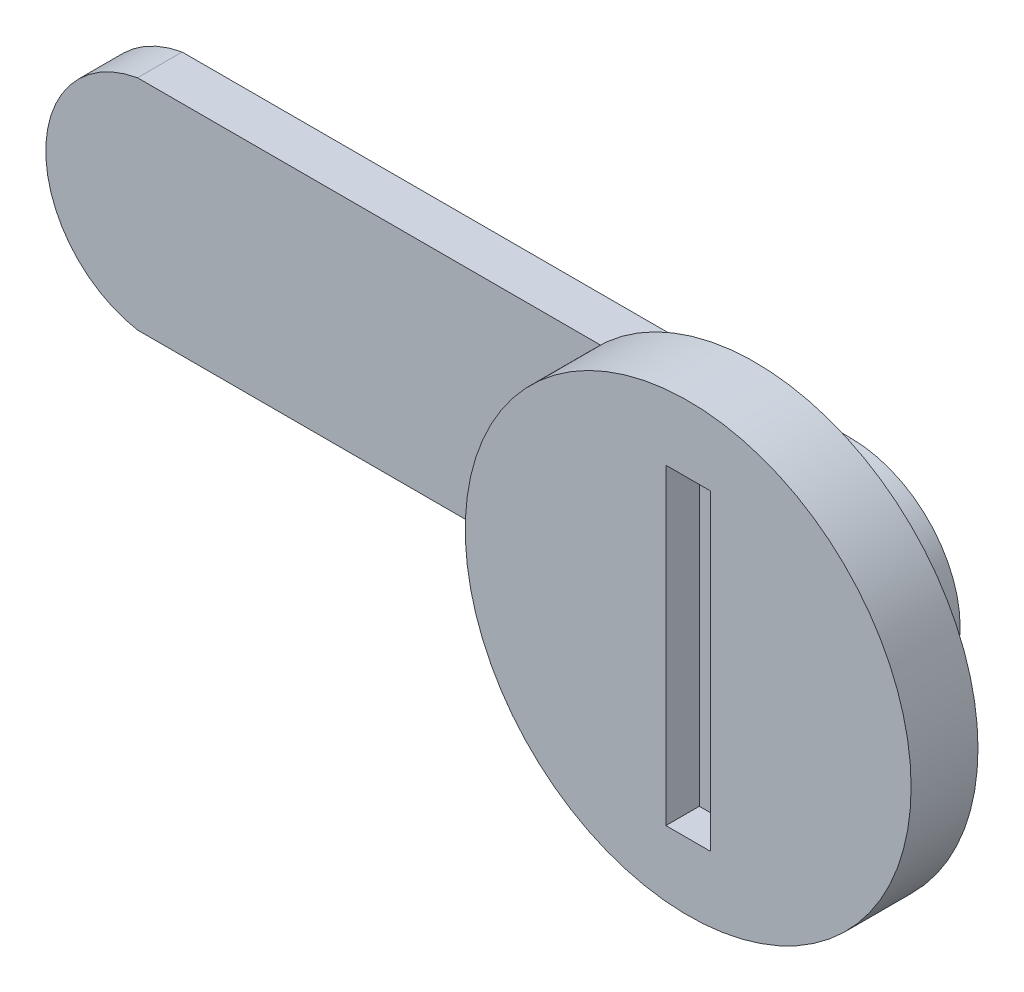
ISO-10303-21;
HEADER;
FILE_DESCRIPTION(('STEP AP214'),'2;1');
FILE_NAME('part.step','',(''),(''),'','','');
FILE_SCHEMA(('AUTOMOTIVE_DESIGN { 1 0 10303 214 1 1 1 1 }'));
ENDSEC;
DATA;
#1=APPLICATION_CONTEXT('core data for automotive mechanical design processes');
#2=APPLICATION_PROTOCOL_DEFINITION('international standard','automotive_design',2000,#1);
#3=PRODUCT_CONTEXT('',#1,'mechanical');
#4=PRODUCT('Part','Part','',(#3));
#5=PRODUCT_RELATED_PRODUCT_CATEGORY('part','',(#4));
#6=PRODUCT_DEFINITION_FORMATION('','',#4);
#7=PRODUCT_DEFINITION_CONTEXT('part definition',#1,'design');
#8=PRODUCT_DEFINITION('design','',#6,#7);
#9=PRODUCT_DEFINITION_SHAPE('','',#8);
#10=(LENGTH_UNIT() NAMED_UNIT(*) SI_UNIT(.MILLI.,.METRE.));
#11=(NAMED_UNIT(*) PLANE_ANGLE_UNIT() SI_UNIT($,.RADIAN.));
#12=(NAMED_UNIT(*) SI_UNIT($,.STERADIAN.) SOLID_ANGLE_UNIT());
#13=UNCERTAINTY_MEASURE_WITH_UNIT(LENGTH_MEASURE(1.E-05),#10,'distance_accuracy_value','');
#14=(GEOMETRIC_REPRESENTATION_CONTEXT(3) GLOBAL_UNCERTAINTY_ASSIGNED_CONTEXT((#13)) GLOBAL_UNIT_ASSIGNED_CONTEXT((#10,
#11,#12)) REPRESENTATION_CONTEXT('',''));
#15=CARTESIAN_POINT('',(0.,0.,0.));
#16=DIRECTION('',(0.,0.,1.));
#17=DIRECTION('',(1.,0.,0.));
#18=AXIS2_PLACEMENT_3D('',#15,#16,#17);
#19=CARTESIAN_POINT('',(0.,0.,3.));
#20=DIRECTION('',(0.,0.,1.));
#21=DIRECTION('',(1.,0.,0.));
#22=AXIS2_PLACEMENT_3D('',#19,#20,#21);
#23=PLANE('',#22);
#24=CARTESIAN_POINT('',(0.,0.,3.));
#25=DIRECTION('',(0.,0.,1.));
#26=DIRECTION('',(1.,0.,0.));
#27=AXIS2_PLACEMENT_3D('',#24,#25,#26);
#28=CIRCLE('',#27,10.);
#29=CARTESIAN_POINT('',(10.,0.,3.));
#30=VERTEX_POINT('',#29);
#31=EDGE_CURVE('E43',#30,#30,#28,.T.);
#32=ORIENTED_EDGE('',*,*,#31,.T.);
#33=EDGE_LOOP('',(#32));
#34=FACE_BOUND('',#33,.T.);
#35=DIRECTION('',(1.,0.,0.));
#36=VECTOR('',#35,1.);
#37=CARTESIAN_POINT('',(0.,7.,3.));
#38=LINE('',#37,#36);
#39=CARTESIAN_POINT('',(-1.,7.,3.));
#40=VERTEX_POINT('',#39);
#41=CARTESIAN_POINT('',(1.,7.,3.));
#42=VERTEX_POINT('',#41);
#43=EDGE_CURVE('E141',#40,#42,#38,.T.);
#44=ORIENTED_EDGE('',*,*,#43,.T.);
#45=DIRECTION('',(0.,-1.,0.));
#46=VECTOR('',#45,1.);
#47=CARTESIAN_POINT('',(1.,0.,3.));
#48=LINE('',#47,#46);
#49=CARTESIAN_POINT('',(0.999999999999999,-7.,3.));
#50=VERTEX_POINT('',#49);
#51=EDGE_CURVE('E59',#42,#50,#48,.T.);
#52=ORIENTED_EDGE('',*,*,#51,.T.);
#53=DIRECTION('',(1.,0.,0.));
#54=VECTOR('',#53,1.);
#55=CARTESIAN_POINT('',(0.,-7.,3.));
#56=LINE('',#55,#54);
#57=CARTESIAN_POINT('',(-0.999999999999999,-7.,3.));
#58=VERTEX_POINT('',#57);
#59=EDGE_CURVE('E132',#58,#50,#56,.T.);
#60=ORIENTED_EDGE('',*,*,#59,.F.);
#61=DIRECTION('',(0.,1.,0.));
#62=VECTOR('',#61,1.);
#63=CARTESIAN_POINT('',(-1.,0.,3.));
#64=LINE('',#63,#62);
#65=EDGE_CURVE('E144',#58,#40,#64,.T.);
#66=ORIENTED_EDGE('',*,*,#65,.T.);
#67=EDGE_LOOP('',(#44,#52,#60,#66));
#68=FACE_BOUND('',#67,.T.);
#69=ADVANCED_FACE('F34',(#34,#68),#23,.T.);
#70=CARTESIAN_POINT('',(0.,0.,3.));
#71=DIRECTION('',(0.,0.,-1.));
#72=DIRECTION('',(-1.,0.,0.));
#73=AXIS2_PLACEMENT_3D('',#70,#71,#72);
#74=CYLINDRICAL_SURFACE('',#73,10.);
#75=ORIENTED_EDGE('',*,*,#31,.F.);
#76=EDGE_LOOP('',(#75));
#77=FACE_BOUND('',#76,.T.);
#78=CARTESIAN_POINT('',(0.,0.,0.));
#79=DIRECTION('',(0.,0.,1.));
#80=DIRECTION('',(1.,0.,0.));
#81=AXIS2_PLACEMENT_3D('',#78,#79,#80);
#82=CIRCLE('',#81,10.);
#83=CARTESIAN_POINT('',(10.,0.,0.));
#84=VERTEX_POINT('',#83);
#85=EDGE_CURVE('E38',#84,#84,#82,.T.);
#86=ORIENTED_EDGE('',*,*,#85,.T.);
#87=EDGE_LOOP('',(#86));
#88=FACE_BOUND('',#87,.T.);
#89=ADVANCED_FACE('F36',(#77,#88),#74,.T.);
#90=CARTESIAN_POINT('',(0.,0.,0.));
#91=DIRECTION('',(0.,0.,1.));
#92=DIRECTION('',(1.,0.,0.));
#93=AXIS2_PLACEMENT_3D('',#90,#91,#92);
#94=PLANE('',#93);
#95=CARTESIAN_POINT('',(0.,0.,0.));
#96=DIRECTION('',(0.,0.,-1.));
#97=DIRECTION('',(-1.,0.,0.));
#98=AXIS2_PLACEMENT_3D('',#95,#96,#97);
#99=CIRCLE('',#98,4.9);
#100=CARTESIAN_POINT('',(-4.9,0.,0.));
#101=VERTEX_POINT('',#100);
#102=EDGE_CURVE('E11',#101,#101,#99,.T.);
#103=ORIENTED_EDGE('',*,*,#102,.F.);
#104=EDGE_LOOP('',(#103));
#105=FACE_BOUND('',#104,.T.);
#106=ORIENTED_EDGE('',*,*,#85,.F.);
#107=EDGE_LOOP('',(#106));
#108=FACE_BOUND('',#107,.T.);
#109=ADVANCED_FACE('F162',(#105,#108),#94,.F.);
#110=CARTESIAN_POINT('',(1.,0.,1.5));
#111=DIRECTION('',(-1.,0.,0.));
#112=DIRECTION('',(0.,-1.,0.));
#113=AXIS2_PLACEMENT_3D('',#110,#111,#112);
#114=PLANE('',#113);
#115=ORIENTED_EDGE('',*,*,#51,.F.);
#116=DIRECTION('',(0.,0.,1.));
#117=VECTOR('',#116,1.);
#118=CARTESIAN_POINT('',(1.,7.,1.5));
#119=LINE('',#118,#117);
#120=CARTESIAN_POINT('',(1.,7.,1.5));
#121=VERTEX_POINT('',#120);
#122=EDGE_CURVE('E139',#121,#42,#119,.T.);
#123=ORIENTED_EDGE('',*,*,#122,.F.);
#124=DIRECTION('',(0.,-1.,0.));
#125=VECTOR('',#124,1.);
#126=CARTESIAN_POINT('',(1.,0.,1.5));
#127=LINE('',#126,#125);
#128=CARTESIAN_POINT('',(0.999999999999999,-7.,1.5));
#129=VERTEX_POINT('',#128);
#130=EDGE_CURVE('E129',#121,#129,#127,.T.);
#131=ORIENTED_EDGE('',*,*,#130,.T.);
#132=DIRECTION('',(0.,0.,1.));
#133=VECTOR('',#132,1.);
#134=CARTESIAN_POINT('',(0.999999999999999,-7.,1.5));
#135=LINE('',#134,#133);
#136=EDGE_CURVE('E149',#129,#50,#135,.T.);
#137=ORIENTED_EDGE('',*,*,#136,.T.);
#138=EDGE_LOOP('',(#115,#123,#131,#137));
#139=FACE_BOUND('',#138,.T.);
#140=ADVANCED_FACE('F164',(#139),#114,.T.);
#141=CARTESIAN_POINT('',(0.,-7.,1.5));
#142=DIRECTION('',(0.,-1.,0.));
#143=DIRECTION('',(0.,0.,-1.));
#144=AXIS2_PLACEMENT_3D('',#141,#142,#143);
#145=PLANE('',#144);
#146=ORIENTED_EDGE('',*,*,#59,.T.);
#147=ORIENTED_EDGE('',*,*,#136,.F.);
#148=DIRECTION('',(1.,0.,0.));
#149=VECTOR('',#148,1.);
#150=CARTESIAN_POINT('',(0.,-7.,1.5));
#151=LINE('',#150,#149);
#152=CARTESIAN_POINT('',(-0.999999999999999,-7.,1.5));
#153=VERTEX_POINT('',#152);
#154=EDGE_CURVE('E136',#153,#129,#151,.T.);
#155=ORIENTED_EDGE('',*,*,#154,.F.);
#156=DIRECTION('',(0.,0.,1.));
#157=VECTOR('',#156,1.);
#158=CARTESIAN_POINT('',(-0.999999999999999,-7.,1.5));
#159=LINE('',#158,#157);
#160=EDGE_CURVE('E151',#153,#58,#159,.T.);
#161=ORIENTED_EDGE('',*,*,#160,.T.);
#162=EDGE_LOOP('',(#146,#147,#155,#161));
#163=FACE_BOUND('',#162,.T.);
#164=ADVANCED_FACE('F170',(#163),#145,.F.);
#165=CARTESIAN_POINT('',(-1.,0.,1.5));
#166=DIRECTION('',(1.,0.,0.));
#167=DIRECTION('',(0.,0.,-1.));
#168=AXIS2_PLACEMENT_3D('',#165,#166,#167);
#169=PLANE('',#168);
#170=ORIENTED_EDGE('',*,*,#65,.F.);
#171=ORIENTED_EDGE('',*,*,#160,.F.);
#172=DIRECTION('',(0.,1.,0.));
#173=VECTOR('',#172,1.);
#174=CARTESIAN_POINT('',(-1.,0.,1.5));
#175=LINE('',#174,#173);
#176=CARTESIAN_POINT('',(-1.,7.,1.5));
#177=VERTEX_POINT('',#176);
#178=EDGE_CURVE('E134',#153,#177,#175,.T.);
#179=ORIENTED_EDGE('',*,*,#178,.T.);
#180=DIRECTION('',(0.,0.,1.));
#181=VECTOR('',#180,1.);
#182=CARTESIAN_POINT('',(-1.,7.,1.5));
#183=LINE('',#182,#181);
#184=EDGE_CURVE('E153',#177,#40,#183,.T.);
#185=ORIENTED_EDGE('',*,*,#184,.T.);
#186=EDGE_LOOP('',(#170,#171,#179,#185));
#187=FACE_BOUND('',#186,.T.);
#188=ADVANCED_FACE('F184',(#187),#169,.T.);
#189=CARTESIAN_POINT('',(0.,7.,1.5));
#190=DIRECTION('',(0.,-1.,0.));
#191=DIRECTION('',(0.,0.,-1.));
#192=AXIS2_PLACEMENT_3D('',#189,#190,#191);
#193=PLANE('',#192);
#194=ORIENTED_EDGE('',*,*,#43,.F.);
#195=ORIENTED_EDGE('',*,*,#184,.F.);
#196=DIRECTION('',(1.,0.,0.));
#197=VECTOR('',#196,1.);
#198=CARTESIAN_POINT('',(0.,7.,1.5));
#199=LINE('',#198,#197);
#200=EDGE_CURVE('E131',#177,#121,#199,.T.);
#201=ORIENTED_EDGE('',*,*,#200,.T.);
#202=ORIENTED_EDGE('',*,*,#122,.T.);
#203=EDGE_LOOP('',(#194,#195,#201,#202));
#204=FACE_BOUND('',#203,.T.);
#205=ADVANCED_FACE('F180',(#204),#193,.T.);
#206=CARTESIAN_POINT('',(0.,0.,1.5));
#207=DIRECTION('',(0.,0.,1.));
#208=DIRECTION('',(1.,0.,0.));
#209=AXIS2_PLACEMENT_3D('',#206,#207,#208);
#210=PLANE('',#209);
#211=ORIENTED_EDGE('',*,*,#130,.F.);
#212=ORIENTED_EDGE('',*,*,#200,.F.);
#213=ORIENTED_EDGE('',*,*,#178,.F.);
#214=ORIENTED_EDGE('',*,*,#154,.T.);
#215=EDGE_LOOP('',(#211,#212,#213,#214));
#216=FACE_BOUND('',#215,.T.);
#217=ADVANCED_FACE('F183',(#216),#210,.T.);
#218=CARTESIAN_POINT('',(0.,0.,-2.3));
#219=DIRECTION('',(0.,0.,1.));
#220=DIRECTION('',(1.,0.,0.));
#221=AXIS2_PLACEMENT_3D('',#218,#219,#220);
#222=CYLINDRICAL_SURFACE('',#221,4.9);
#223=CARTESIAN_POINT('',(0.,0.,-2.3));
#224=DIRECTION('',(0.,0.,-1.));
#225=DIRECTION('',(-1.,0.,0.));
#226=AXIS2_PLACEMENT_3D('',#223,#224,#225);
#227=CIRCLE('',#226,4.9);
#228=CARTESIAN_POINT('',(0.,-4.9,-2.3));
#229=VERTEX_POINT('',#228);
#230=CARTESIAN_POINT('',(0.,4.9,-2.3));
#231=VERTEX_POINT('',#230);
#232=EDGE_CURVE('E51',#229,#231,#227,.T.);
#233=ORIENTED_EDGE('',*,*,#232,.F.);
#234=DIRECTION('',(0.,0.,1.));
#235=VECTOR('',#234,1.);
#236=CARTESIAN_POINT('',(0.,-4.9,-4.3));
#237=LINE('',#236,#235);
#238=CARTESIAN_POINT('',(0.,-4.9,-4.3));
#239=VERTEX_POINT('',#238);
#240=EDGE_CURVE('E106',#239,#229,#237,.T.);
#241=ORIENTED_EDGE('',*,*,#240,.F.);
#242=CARTESIAN_POINT('',(0.,0.,-4.3));
#243=DIRECTION('',(0.,0.,-1.));
#244=DIRECTION('',(-1.,0.,0.));
#245=AXIS2_PLACEMENT_3D('',#242,#243,#244);
#246=CIRCLE('',#245,4.9);
#247=CARTESIAN_POINT('',(0.,4.9,-4.3));
#248=VERTEX_POINT('',#247);
#249=EDGE_CURVE('E112',#248,#239,#246,.T.);
#250=ORIENTED_EDGE('',*,*,#249,.F.);
#251=DIRECTION('',(0.,0.,1.));
#252=VECTOR('',#251,1.);
#253=CARTESIAN_POINT('',(0.,4.9,-4.3));
#254=LINE('',#253,#252);
#255=EDGE_CURVE('E312',#248,#231,#254,.T.);
#256=ORIENTED_EDGE('',*,*,#255,.T.);
#257=EDGE_LOOP('',(#233,#241,#250,#256));
#258=FACE_BOUND('',#257,.T.);
#259=ORIENTED_EDGE('',*,*,#102,.T.);
#260=EDGE_LOOP('',(#259));
#261=FACE_BOUND('',#260,.T.);
#262=ADVANCED_FACE('F121',(#258,#261),#222,.T.);
#263=CARTESIAN_POINT('',(0.,0.,-2.3));
#264=DIRECTION('',(0.,0.,-1.));
#265=DIRECTION('',(-1.,0.,0.));
#266=AXIS2_PLACEMENT_3D('',#263,#264,#265);
#267=PLANE('',#266);
#268=DIRECTION('',(-1.,0.,0.));
#269=VECTOR('',#268,1.);
#270=CARTESIAN_POINT('',(0.,-4.9,-2.3));
#271=LINE('',#270,#269);
#272=CARTESIAN_POINT('',(-30.,-4.9,-2.3));
#273=VERTEX_POINT('',#272);
#274=EDGE_CURVE('E302',#229,#273,#271,.T.);
#275=ORIENTED_EDGE('',*,*,#274,.F.);
#276=ORIENTED_EDGE('',*,*,#232,.T.);
#277=DIRECTION('',(1.,0.,0.));
#278=VECTOR('',#277,1.);
#279=CARTESIAN_POINT('',(0.,4.9,-2.3));
#280=LINE('',#279,#278);
#281=CARTESIAN_POINT('',(-30.,4.9,-2.3));
#282=VERTEX_POINT('',#281);
#283=EDGE_CURVE('E119',#282,#231,#280,.T.);
#284=ORIENTED_EDGE('',*,*,#283,.F.);
#285=CARTESIAN_POINT('',(-29.1391422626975,0.,-2.3));
#286=DIRECTION('',(0.,0.,-1.));
#287=DIRECTION('',(-1.,0.,0.));
#288=AXIS2_PLACEMENT_3D('',#285,#286,#287);
#289=CIRCLE('',#288,4.97504533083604);
#290=EDGE_CURVE('E305',#273,#282,#289,.T.);
#291=ORIENTED_EDGE('',*,*,#290,.F.);
#292=EDGE_LOOP('',(#275,#276,#284,#291));
#293=FACE_BOUND('',#292,.T.);
#294=ADVANCED_FACE('F197',(#293),#267,.F.);
#295=CARTESIAN_POINT('',(0.,-4.9,-4.3));
#296=DIRECTION('',(0.,1.,0.));
#297=DIRECTION('',(0.,0.,1.));
#298=AXIS2_PLACEMENT_3D('',#295,#296,#297);
#299=PLANE('',#298);
#300=ORIENTED_EDGE('',*,*,#274,.T.);
#301=DIRECTION('',(0.,0.,1.));
#302=VECTOR('',#301,1.);
#303=CARTESIAN_POINT('',(-30.,-4.9,-4.3));
#304=LINE('',#303,#302);
#305=CARTESIAN_POINT('',(-30.,-4.9,-4.3));
#306=VERTEX_POINT('',#305);
#307=EDGE_CURVE('E108',#306,#273,#304,.T.);
#308=ORIENTED_EDGE('',*,*,#307,.F.);
#309=DIRECTION('',(-1.,0.,0.));
#310=VECTOR('',#309,1.);
#311=CARTESIAN_POINT('',(0.,-4.9,-4.3));
#312=LINE('',#311,#310);
#313=EDGE_CURVE('E103',#239,#306,#312,.T.);
#314=ORIENTED_EDGE('',*,*,#313,.F.);
#315=ORIENTED_EDGE('',*,*,#240,.T.);
#316=EDGE_LOOP('',(#300,#308,#314,#315));
#317=FACE_BOUND('',#316,.T.);
#318=ADVANCED_FACE('F105',(#317),#299,.F.);
#319=CARTESIAN_POINT('',(-29.1391422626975,0.,-4.3));
#320=DIRECTION('',(0.,0.,1.));
#321=DIRECTION('',(1.,0.,0.));
#322=AXIS2_PLACEMENT_3D('',#319,#320,#321);
#323=CYLINDRICAL_SURFACE('',#322,4.97504533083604);
#324=ORIENTED_EDGE('',*,*,#290,.T.);
#325=DIRECTION('',(0.,0.,1.));
#326=VECTOR('',#325,1.);
#327=CARTESIAN_POINT('',(-30.,4.9,-4.3));
#328=LINE('',#327,#326);
#329=CARTESIAN_POINT('',(-30.,4.9,-4.3));
#330=VERTEX_POINT('',#329);
#331=EDGE_CURVE('E125',#330,#282,#328,.T.);
#332=ORIENTED_EDGE('',*,*,#331,.F.);
#333=CARTESIAN_POINT('',(-29.1391422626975,0.,-4.3));
#334=DIRECTION('',(0.,0.,-1.));
#335=DIRECTION('',(-1.,0.,0.));
#336=AXIS2_PLACEMENT_3D('',#333,#334,#335);
#337=CIRCLE('',#336,4.97504533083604);
#338=EDGE_CURVE('E111',#306,#330,#337,.T.);
#339=ORIENTED_EDGE('',*,*,#338,.F.);
#340=ORIENTED_EDGE('',*,*,#307,.T.);
#341=EDGE_LOOP('',(#324,#332,#339,#340));
#342=FACE_BOUND('',#341,.T.);
#343=ADVANCED_FACE('F200',(#342),#323,.T.);
#344=CARTESIAN_POINT('',(0.,4.9,-4.3));
#345=DIRECTION('',(0.,-1.,0.));
#346=DIRECTION('',(0.,0.,-1.));
#347=AXIS2_PLACEMENT_3D('',#344,#345,#346);
#348=PLANE('',#347);
#349=ORIENTED_EDGE('',*,*,#283,.T.);
#350=ORIENTED_EDGE('',*,*,#255,.F.);
#351=DIRECTION('',(1.,0.,0.));
#352=VECTOR('',#351,1.);
#353=CARTESIAN_POINT('',(0.,4.9,-4.3));
#354=LINE('',#353,#352);
#355=EDGE_CURVE('E117',#330,#248,#354,.T.);
#356=ORIENTED_EDGE('',*,*,#355,.F.);
#357=ORIENTED_EDGE('',*,*,#331,.T.);
#358=EDGE_LOOP('',(#349,#350,#356,#357));
#359=FACE_BOUND('',#358,.T.);
#360=ADVANCED_FACE('F203',(#359),#348,.F.);
#361=CARTESIAN_POINT('',(0.,0.,-4.3));
#362=DIRECTION('',(0.,0.,-1.));
#363=DIRECTION('',(-1.,0.,0.));
#364=AXIS2_PLACEMENT_3D('',#361,#362,#363);
#365=PLANE('',#364);
#366=ORIENTED_EDGE('',*,*,#249,.T.);
#367=ORIENTED_EDGE('',*,*,#313,.T.);
#368=ORIENTED_EDGE('',*,*,#338,.T.);
#369=ORIENTED_EDGE('',*,*,#355,.T.);
#370=EDGE_LOOP('',(#366,#367,#368,#369));
#371=FACE_BOUND('',#370,.T.);
#372=ADVANCED_FACE('F115',(#371),#365,.T.);
#373=CLOSED_SHELL('',(#69,#89,#109,#140,#164,#188,#205,#217,#262,#294,#318,#343,#360,#372));
#374=MANIFOLD_SOLID_BREP('B2',#373);
#375=ADVANCED_BREP_SHAPE_REPRESENTATION('',(#18,#374),#14);
#376=SHAPE_DEFINITION_REPRESENTATION(#9,#375);
ENDSEC;
END-ISO-10303-21;
